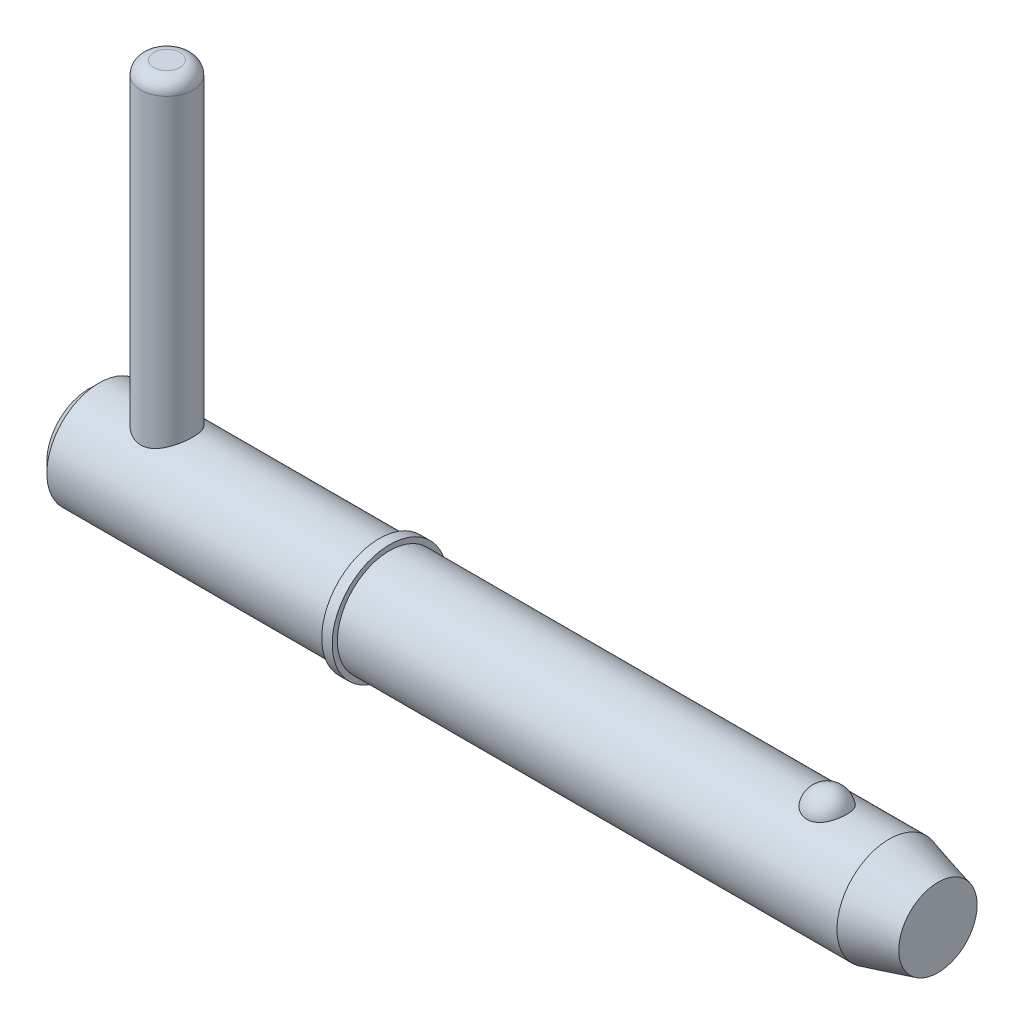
ISO-10303-21;
HEADER;
FILE_DESCRIPTION(('STEP AP214'),'2;1');
FILE_NAME('part.step','',(''),(''),'','','');
FILE_SCHEMA(('AUTOMOTIVE_DESIGN { 1 0 10303 214 1 1 1 1 }'));
ENDSEC;
DATA;
#1=APPLICATION_CONTEXT('core data for automotive mechanical design processes');
#2=APPLICATION_PROTOCOL_DEFINITION('international standard','automotive_design',2000,#1);
#3=PRODUCT_CONTEXT('',#1,'mechanical');
#4=PRODUCT('Part','Part','',(#3));
#5=PRODUCT_RELATED_PRODUCT_CATEGORY('part','',(#4));
#6=PRODUCT_DEFINITION_FORMATION('','',#4);
#7=PRODUCT_DEFINITION_CONTEXT('part definition',#1,'design');
#8=PRODUCT_DEFINITION('design','',#6,#7);
#9=PRODUCT_DEFINITION_SHAPE('','',#8);
#10=(LENGTH_UNIT() NAMED_UNIT(*) SI_UNIT(.MILLI.,.METRE.));
#11=(NAMED_UNIT(*) PLANE_ANGLE_UNIT() SI_UNIT($,.RADIAN.));
#12=(NAMED_UNIT(*) SI_UNIT($,.STERADIAN.) SOLID_ANGLE_UNIT());
#13=UNCERTAINTY_MEASURE_WITH_UNIT(LENGTH_MEASURE(1.E-05),#10,'distance_accuracy_value','');
#14=(GEOMETRIC_REPRESENTATION_CONTEXT(3) GLOBAL_UNCERTAINTY_ASSIGNED_CONTEXT((#13)) GLOBAL_UNIT_ASSIGNED_CONTEXT((#10,
#11,#12)) REPRESENTATION_CONTEXT('',''));
#15=CARTESIAN_POINT('',(0.,0.,0.));
#16=DIRECTION('',(0.,0.,1.));
#17=DIRECTION('',(1.,0.,0.));
#18=AXIS2_PLACEMENT_3D('',#15,#16,#17);
#19=CARTESIAN_POINT('',(4.755,22.225,0.));
#20=DIRECTION('',(0.,-1.,0.));
#21=DIRECTION('',(0.,0.,-1.));
#22=AXIS2_PLACEMENT_3D('',#19,#20,#21);
#23=CYLINDRICAL_SURFACE('',#22,1.585);
#24=CARTESIAN_POINT('',(4.755,-2.3825,0.));
#25=DIRECTION('',(0.,1.,0.));
#26=DIRECTION('',(0.,0.,1.));
#27=AXIS2_PLACEMENT_3D('',#24,#25,#26);
#28=CIRCLE('',#27,1.585);
#29=CARTESIAN_POINT('',(4.755,-2.3825,1.585));
#30=VERTEX_POINT('',#29);
#31=EDGE_CURVE('P0_E25',#30,#30,#28,.T.);
#32=ORIENTED_EDGE('',*,*,#31,.T.);
#33=EDGE_LOOP('',(#32));
#34=FACE_BOUND('',#33,.T.);
#35=CARTESIAN_POINT('',(4.755,21.4325,0.));
#36=DIRECTION('',(0.,1.,0.));
#37=DIRECTION('',(0.,0.,1.));
#38=AXIS2_PLACEMENT_3D('',#35,#36,#37);
#39=CIRCLE('',#38,1.585);
#40=CARTESIAN_POINT('',(4.755,21.4325,1.585));
#41=VERTEX_POINT('',#40);
#42=EDGE_CURVE('P0_E29',#41,#41,#39,.F.);
#43=ORIENTED_EDGE('',*,*,#42,.T.);
#44=EDGE_LOOP('',(#43));
#45=FACE_BOUND('',#44,.T.);
#46=ADVANCED_FACE('P0_F14',(#34,#45),#23,.T.);
#47=CARTESIAN_POINT('',(4.755,22.225,0.));
#48=DIRECTION('',(0.,1.,0.));
#49=DIRECTION('',(0.,0.,1.));
#50=AXIS2_PLACEMENT_3D('',#47,#48,#49);
#51=PLANE('',#50);
#52=CARTESIAN_POINT('',(4.755,22.225,0.));
#53=DIRECTION('',(0.,1.,0.));
#54=DIRECTION('',(0.,0.,1.));
#55=AXIS2_PLACEMENT_3D('',#52,#53,#54);
#56=CIRCLE('',#55,0.7925);
#57=CARTESIAN_POINT('',(4.755,22.225,0.7925));
#58=VERTEX_POINT('',#57);
#59=EDGE_CURVE('P0_E10',#58,#58,#56,.T.);
#60=ORIENTED_EDGE('',*,*,#59,.T.);
#61=EDGE_LOOP('',(#60));
#62=FACE_BOUND('',#61,.T.);
#63=ADVANCED_FACE('P0_F46',(#62),#51,.T.);
#64=CARTESIAN_POINT('',(4.755,-3.175,0.));
#65=DIRECTION('',(0.,1.,0.));
#66=DIRECTION('',(0.,0.,1.));
#67=AXIS2_PLACEMENT_3D('',#64,#65,#66);
#68=PLANE('',#67);
#69=CARTESIAN_POINT('',(4.755,-3.175,0.));
#70=DIRECTION('',(0.,1.,0.));
#71=DIRECTION('',(0.,0.,1.));
#72=AXIS2_PLACEMENT_3D('',#69,#70,#71);
#73=CIRCLE('',#72,0.7925);
#74=CARTESIAN_POINT('',(4.755,-3.175,0.7925));
#75=VERTEX_POINT('',#74);
#76=EDGE_CURVE('P0_E21',#75,#75,#73,.F.);
#77=ORIENTED_EDGE('',*,*,#76,.T.);
#78=EDGE_LOOP('',(#77));
#79=FACE_BOUND('',#78,.T.);
#80=ADVANCED_FACE('P0_F43',(#79),#68,.F.);
#81=CARTESIAN_POINT('',(4.755,-2.3825,0.));
#82=DIRECTION('',(0.,1.,0.));
#83=DIRECTION('',(0.,0.,1.));
#84=AXIS2_PLACEMENT_3D('',#81,#82,#83);
#85=DEGENERATE_TOROIDAL_SURFACE('',#84,0.7925,0.7925,.T.);
#86=ORIENTED_EDGE('',*,*,#76,.F.);
#87=EDGE_LOOP('',(#86));
#88=FACE_BOUND('',#87,.T.);
#89=ORIENTED_EDGE('',*,*,#31,.F.);
#90=EDGE_LOOP('',(#89));
#91=FACE_BOUND('',#90,.T.);
#92=ADVANCED_FACE('P0_F38',(#88,#91),#85,.T.);
#93=CARTESIAN_POINT('',(4.755,21.4325,0.));
#94=DIRECTION('',(0.,1.,0.));
#95=DIRECTION('',(0.,0.,1.));
#96=AXIS2_PLACEMENT_3D('',#93,#94,#95);
#97=DEGENERATE_TOROIDAL_SURFACE('',#96,0.7925,0.7925,.T.);
#98=ORIENTED_EDGE('',*,*,#42,.F.);
#99=EDGE_LOOP('',(#98));
#100=FACE_BOUND('',#99,.T.);
#101=ORIENTED_EDGE('',*,*,#59,.F.);
#102=EDGE_LOOP('',(#101));
#103=FACE_BOUND('',#102,.T.);
#104=ADVANCED_FACE('P0_F16',(#100,#103),#97,.T.);
#105=CLOSED_SHELL('',(#46,#63,#80,#92,#104));
#106=MANIFOLD_SOLID_BREP('P0_B1',#105);
#107=CARTESIAN_POINT('',(0.,0.,0.));
#108=DIRECTION('',(1.,0.,0.));
#109=DIRECTION('',(0.,0.,-1.));
#110=AXIS2_PLACEMENT_3D('',#107,#108,#109);
#111=CYLINDRICAL_SURFACE('',#110,3.175);
#112=CARTESIAN_POINT('',(48.6476846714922,0.,0.));
#113=DIRECTION('',(1.,0.,0.));
#114=DIRECTION('',(0.,0.,-1.));
#115=AXIS2_PLACEMENT_3D('',#112,#113,#114);
#116=CIRCLE('',#115,3.175);
#117=CARTESIAN_POINT('',(48.6476846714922,0.,-3.175));
#118=VERTEX_POINT('',#117);
#119=EDGE_CURVE('P1_E81',#118,#118,#116,.T.);
#120=ORIENTED_EDGE('',*,*,#119,.F.);
#121=EDGE_LOOP('',(#120));
#122=FACE_BOUND('',#121,.T.);
#123=CARTESIAN_POINT('',(18.29,0.,0.));
#124=DIRECTION('',(1.,0.,0.));
#125=DIRECTION('',(0.,0.,-1.));
#126=AXIS2_PLACEMENT_3D('',#123,#124,#125);
#127=CIRCLE('',#126,3.175);
#128=CARTESIAN_POINT('',(18.29,0.,-3.175));
#129=VERTEX_POINT('',#128);
#130=EDGE_CURVE('P1_E85',#129,#129,#127,.T.);
#131=ORIENTED_EDGE('',*,*,#130,.T.);
#132=EDGE_LOOP('',(#131));
#133=FACE_BOUND('',#132,.T.);
#134=CARTESIAN_POINT('',(44.8757276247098,2.92898950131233,1.2254164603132));
#135=CARTESIAN_POINT('',(44.812316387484,2.92899434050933,1.22541146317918));
#136=CARTESIAN_POINT('',(44.7487979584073,2.93112688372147,1.2203464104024));
#137=CARTESIAN_POINT('',(44.6235306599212,2.93942752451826,1.20020949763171));
#138=CARTESIAN_POINT('',(44.5617869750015,2.9456063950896,1.18511092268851));
#139=CARTESIAN_POINT('',(44.4420651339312,2.96127115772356,1.14540352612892));
#140=CARTESIAN_POINT('',(44.3840775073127,2.97074831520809,1.12081980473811));
#141=CARTESIAN_POINT('',(44.2731943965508,2.99197584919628,1.06285154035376));
#142=CARTESIAN_POINT('',(44.2202966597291,3.0037252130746,1.02947091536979));
#143=CARTESIAN_POINT('',(44.1192688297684,3.02865714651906,0.95367409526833));
#144=CARTESIAN_POINT('',(44.071324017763,3.04187163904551,0.911021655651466));
#145=CARTESIAN_POINT('',(43.9830360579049,3.06808741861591,0.818400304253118));
#146=CARTESIAN_POINT('',(43.9426952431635,3.08108863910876,0.768429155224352));
#147=CARTESIAN_POINT('',(43.8688039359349,3.10614903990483,0.6600648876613));
#148=CARTESIAN_POINT('',(43.8356330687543,3.11814104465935,0.601396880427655));
#149=CARTESIAN_POINT('',(43.7791190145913,3.13926931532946,0.479026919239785));
#150=CARTESIAN_POINT('',(43.7557764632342,3.14840539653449,0.415324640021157));
#151=CARTESIAN_POINT('',(43.7191785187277,3.16298160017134,0.283885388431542));
#152=CARTESIAN_POINT('',(43.7060407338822,3.16837855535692,0.216110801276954));
#153=CARTESIAN_POINT('',(43.6905676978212,3.17475386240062,0.0791367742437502));
#154=CARTESIAN_POINT('',(43.688232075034,3.17573236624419,0.00993738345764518));
#155=CARTESIAN_POINT('',(43.694388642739,3.17318075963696,-0.127420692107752));
#156=CARTESIAN_POINT('',(43.7028073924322,3.16968122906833,-0.195583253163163));
#157=CARTESIAN_POINT('',(43.7301752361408,3.1585790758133,-0.329413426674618));
#158=CARTESIAN_POINT('',(43.7491245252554,3.15097637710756,-0.395080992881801));
#159=CARTESIAN_POINT('',(43.7972057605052,3.13242485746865,-0.522180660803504));
#160=CARTESIAN_POINT('',(43.8263524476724,3.12147119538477,-0.583606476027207));
#161=CARTESIAN_POINT('',(43.8942352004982,3.09734973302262,-0.700436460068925));
#162=CARTESIAN_POINT('',(43.932972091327,3.08418174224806,-0.7558401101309));
#163=CARTESIAN_POINT('',(44.0194771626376,3.05694884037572,-0.859404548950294));
#164=CARTESIAN_POINT('',(44.0672961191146,3.04287919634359,-0.907521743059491));
#165=CARTESIAN_POINT('',(44.1707353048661,3.01548927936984,-0.994758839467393));
#166=CARTESIAN_POINT('',(44.2263549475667,3.00216895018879,-1.03387941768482));
#167=CARTESIAN_POINT('',(44.3428093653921,2.97810316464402,-1.10126594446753));
#168=CARTESIAN_POINT('',(44.4035182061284,2.96731170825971,-1.12973256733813));
#169=CARTESIAN_POINT('',(44.5293712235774,2.9492893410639,-1.17598467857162));
#170=CARTESIAN_POINT('',(44.5945137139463,2.94205708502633,-1.19377420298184));
#171=CARTESIAN_POINT('',(44.7238562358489,2.93233065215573,-1.21746387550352));
#172=CARTESIAN_POINT('',(44.7879385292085,2.92961621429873,-1.22391763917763));
#173=CARTESIAN_POINT('',(44.9163375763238,2.92855752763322,-1.22644976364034));
#174=CARTESIAN_POINT('',(44.980654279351,2.93021238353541,-1.22253024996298));
#175=CARTESIAN_POINT('',(45.1055239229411,2.9375685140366,-1.20474140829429));
#176=CARTESIAN_POINT('',(45.166131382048,2.94313790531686,-1.19119621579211));
#177=CARTESIAN_POINT('',(45.2841106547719,2.95756226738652,-1.15491492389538));
#178=CARTESIAN_POINT('',(45.3414822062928,2.96641750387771,-1.13217808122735));
#179=CARTESIAN_POINT('',(45.4527699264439,2.98669918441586,-1.07755083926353));
#180=CARTESIAN_POINT('',(45.5065845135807,2.9981771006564,-1.0454730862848));
#181=CARTESIAN_POINT('',(45.6081473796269,3.02240235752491,-0.973220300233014));
#182=CARTESIAN_POINT('',(45.6558942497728,3.03514999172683,-0.933043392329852));
#183=CARTESIAN_POINT('',(45.7465817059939,3.06131230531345,-0.843372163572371));
#184=CARTESIAN_POINT('',(45.7891588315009,3.07472822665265,-0.793510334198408));
#185=CARTESIAN_POINT('',(45.8656765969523,3.10021106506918,-0.687241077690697));
#186=CARTESIAN_POINT('',(45.8996156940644,3.1122777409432,-0.630832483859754));
#187=CARTESIAN_POINT('',(45.9591209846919,3.134208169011,-0.511059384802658));
#188=CARTESIAN_POINT('',(45.9843892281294,3.14399040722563,-0.447531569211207));
#189=CARTESIAN_POINT('',(46.0245117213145,3.15983820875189,-0.316827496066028));
#190=CARTESIAN_POINT('',(46.0393659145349,3.16590375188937,-0.249651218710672));
#191=CARTESIAN_POINT('',(46.058358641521,3.17370076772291,-0.11354918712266));
#192=CARTESIAN_POINT('',(46.0624966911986,3.17543204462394,-0.0446233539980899));
#193=CARTESIAN_POINT('',(46.0599697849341,3.17438372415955,0.0929938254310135));
#194=CARTESIAN_POINT('',(46.0533050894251,3.17160423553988,0.161685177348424));
#195=CARTESIAN_POINT('',(46.0293754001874,3.1618438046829,0.296502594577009));
#196=CARTESIAN_POINT('',(46.0121674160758,3.15488546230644,0.362640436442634));
#197=CARTESIAN_POINT('',(45.967547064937,3.13748892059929,0.490896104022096));
#198=CARTESIAN_POINT('',(45.9401339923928,3.12705048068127,0.553013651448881));
#199=CARTESIAN_POINT('',(45.8754626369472,3.10369139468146,0.671876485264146));
#200=CARTESIAN_POINT('',(45.8381467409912,3.0907563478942,0.728587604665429));
#201=CARTESIAN_POINT('',(45.7545246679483,3.06381731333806,0.834653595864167));
#202=CARTESIAN_POINT('',(45.7082189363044,3.04981337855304,0.884008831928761));
#203=CARTESIAN_POINT('',(45.6077184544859,3.02230423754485,0.973916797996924));
#204=CARTESIAN_POINT('',(45.553535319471,3.00879833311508,1.01448227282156));
#205=CARTESIAN_POINT('',(45.4385299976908,2.98383625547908,1.0857155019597));
#206=CARTESIAN_POINT('',(45.3777053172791,2.9723808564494,1.11637952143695));
#207=CARTESIAN_POINT('',(45.2533690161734,2.95329063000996,1.16592590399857));
#208=CARTESIAN_POINT('',(45.1900230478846,2.9455373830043,1.18517901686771));
#209=CARTESIAN_POINT('',(45.0607664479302,2.9342556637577,1.21284802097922));
#210=CARTESIAN_POINT('',(44.9948641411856,2.93071450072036,1.2212964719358));
#211=CARTESIAN_POINT('',(44.911116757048,2.9291525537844,1.22502505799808));
#212=CARTESIAN_POINT('',(44.8934263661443,2.92898815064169,1.22541785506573));
#213=CARTESIAN_POINT('',(44.8757276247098,2.92898950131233,1.2254164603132));
#214=B_SPLINE_CURVE_WITH_KNOTS('',3,(#134,#135,#136,#137,#138,#139,#140,#141,#142,#143,#144,
#145,#146,#147,#148,#149,#150,#151,#152,#153,#154,#155,#156,#157,#158,#159,#160,#161,#162,#163,
#164,#165,#166,#167,#168,#169,#170,#171,#172,#173,#174,#175,#176,#177,#178,#179,#180,#181,#182,
#183,#184,#185,#186,#187,#188,#189,#190,#191,#192,#193,#194,#195,#196,#197,#198,#199,#200,#201,
#202,#203,#204,#205,#206,#207,#208,#209,#210,#211,#212,#213),.UNSPECIFIED.,.T.,.F.,(4,2,2,2,2,2,
2,2,2,2,2,2,2,2,2,2,2,2,2,2,2,2,2,2,2,2,2,2,2,2,2,2,2,2,2,2,2,2,2,4),(0.,0.190186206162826,
0.380880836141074,0.571074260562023,0.761183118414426,0.956866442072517,1.15260970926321,
1.35701770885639,1.56143892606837,1.76818248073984,1.97491892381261,2.18025109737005,
2.38558707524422,2.59122111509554,2.79687285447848,3.00371012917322,3.2105318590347,
3.41323429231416,3.61586005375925,3.80828192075,4.00066436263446,4.18685798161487,
4.37306665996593,4.56330302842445,4.75358348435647,4.95345287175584,5.15335793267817,
5.35957003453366,5.56578325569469,5.77200579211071,5.97822335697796,6.183335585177,
6.38846199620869,6.59480900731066,6.80114579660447,7.00718137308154,7.21329457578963,
7.41228022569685,7.61066481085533,7.66374777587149),.UNSPECIFIED.);
#215=CARTESIAN_POINT('',(44.8757276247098,2.92898950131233,1.2254164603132));
#216=VERTEX_POINT('',#215);
#217=EDGE_CURVE('P1_E35',#216,#216,#214,.T.);
#218=ORIENTED_EDGE('',*,*,#217,.T.);
#219=EDGE_LOOP('',(#218));
#220=FACE_BOUND('',#219,.T.);
#221=ADVANCED_FACE('P1_F13',(#122,#133,#220),#111,.T.);
#222=CARTESIAN_POINT('',(0.,0.,0.));
#223=DIRECTION('',(-1.,0.,0.));
#224=DIRECTION('',(0.,0.,1.));
#225=AXIS2_PLACEMENT_3D('',#222,#223,#224);
#226=PLANE('',#225);
#227=CARTESIAN_POINT('',(0.,0.,0.));
#228=DIRECTION('',(1.,0.,0.));
#229=DIRECTION('',(0.,0.,-1.));
#230=AXIS2_PLACEMENT_3D('',#227,#228,#229);
#231=CIRCLE('',#230,2.54);
#232=CARTESIAN_POINT('',(0.,0.,-2.54));
#233=VERTEX_POINT('',#232);
#234=EDGE_CURVE('P1_E9',#233,#233,#231,.T.);
#235=ORIENTED_EDGE('',*,*,#234,.F.);
#236=EDGE_LOOP('',(#235));
#237=FACE_BOUND('',#236,.T.);
#238=ADVANCED_FACE('P1_F15',(#237),#226,.T.);
#239=CARTESIAN_POINT('',(0.634999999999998,0.,0.));
#240=DIRECTION('',(1.,0.,0.));
#241=DIRECTION('',(0.,0.,-1.));
#242=AXIS2_PLACEMENT_3D('',#239,#240,#241);
#243=CONICAL_SURFACE('',#242,3.175,0.78539816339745);
#244=ORIENTED_EDGE('',*,*,#234,.T.);
#245=EDGE_LOOP('',(#244));
#246=FACE_BOUND('',#245,.T.);
#247=CARTESIAN_POINT('',(0.634999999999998,0.,0.));
#248=DIRECTION('',(1.,0.,0.));
#249=DIRECTION('',(0.,0.,-1.));
#250=AXIS2_PLACEMENT_3D('',#247,#248,#249);
#251=CIRCLE('',#250,3.175);
#252=CARTESIAN_POINT('',(0.634999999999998,0.,-3.175));
#253=VERTEX_POINT('',#252);
#254=EDGE_CURVE('P1_E26',#253,#253,#251,.T.);
#255=ORIENTED_EDGE('',*,*,#254,.F.);
#256=EDGE_LOOP('',(#255));
#257=FACE_BOUND('',#256,.T.);
#258=ADVANCED_FACE('P1_F77',(#246,#257),#243,.T.);
#259=CARTESIAN_POINT('',(0.,0.,0.));
#260=DIRECTION('',(1.,0.,0.));
#261=DIRECTION('',(0.,0.,-1.));
#262=AXIS2_PLACEMENT_3D('',#259,#260,#261);
#263=CYLINDRICAL_SURFACE('',#262,3.175);
#264=CARTESIAN_POINT('',(4.755,-2.75107251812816,1.585));
#265=CARTESIAN_POINT('',(4.67238891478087,-2.7510796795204,1.58499425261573));
#266=CARTESIAN_POINT('',(4.58967306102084,-2.75485010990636,1.57849830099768));
#267=CARTESIAN_POINT('',(4.42677850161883,-2.76938647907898,1.55284486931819));
#268=CARTESIAN_POINT('',(4.34660551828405,-2.78016716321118,1.53366069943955));
#269=CARTESIAN_POINT('',(4.19146029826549,-2.80716278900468,1.48366329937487));
#270=CARTESIAN_POINT('',(4.11646293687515,-2.8233488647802,1.45291173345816));
#271=CARTESIAN_POINT('',(3.97271079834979,-2.85928672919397,1.38084067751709));
#272=CARTESIAN_POINT('',(3.90395634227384,-2.87903870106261,1.33952064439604));
#273=CARTESIAN_POINT('',(3.76839976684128,-2.921867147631,1.24350234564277));
#274=CARTESIAN_POINT('',(3.702222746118,-2.94508343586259,1.18798355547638));
#275=CARTESIAN_POINT('',(3.5796334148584,-2.99109588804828,1.06685014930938));
#276=CARTESIAN_POINT('',(3.52322596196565,-3.01389183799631,1.00123054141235));
#277=CARTESIAN_POINT('',(3.41807024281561,-3.05832598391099,0.856373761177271));
#278=CARTESIAN_POINT('',(3.37009053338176,-3.07978367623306,0.776518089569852));
#279=CARTESIAN_POINT('',(3.28853137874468,-3.11730894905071,0.608596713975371));
#280=CARTESIAN_POINT('',(3.25494287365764,-3.1333799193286,0.520536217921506));
#281=CARTESIAN_POINT('',(3.20559401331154,-3.15731341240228,0.345327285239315));
#282=CARTESIAN_POINT('',(3.18873760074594,-3.16567752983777,0.258557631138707));
#283=CARTESIAN_POINT('',(3.16972238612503,-3.17512718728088,0.0830496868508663));
#284=CARTESIAN_POINT('',(3.16755472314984,-3.17621711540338,-0.00568738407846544));
#285=CARTESIAN_POINT('',(3.1775542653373,-3.17123385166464,-0.174372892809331));
#286=CARTESIAN_POINT('',(3.18849502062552,-3.16577346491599,-0.254416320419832));
#287=CARTESIAN_POINT('',(3.22220680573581,-3.14922844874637,-0.411354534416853));
#288=CARTESIAN_POINT('',(3.2449787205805,-3.13814339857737,-0.488249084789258));
#289=CARTESIAN_POINT('',(3.30185558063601,-3.111172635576,-0.638050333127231));
#290=CARTESIAN_POINT('',(3.33611332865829,-3.09522247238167,-0.710886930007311));
#291=CARTESIAN_POINT('',(3.41477890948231,-3.05996035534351,-0.849953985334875));
#292=CARTESIAN_POINT('',(3.45919037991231,-3.04064719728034,-0.916182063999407));
#293=CARTESIAN_POINT('',(3.5617148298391,-2.99832415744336,-1.04681642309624));
#294=CARTESIAN_POINT('',(3.62072497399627,-2.97513741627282,-1.11046186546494));
#295=CARTESIAN_POINT('',(3.7483697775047,-2.92885066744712,-1.22736291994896));
#296=CARTESIAN_POINT('',(3.81701173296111,-2.90575073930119,-1.2806105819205));
#297=CARTESIAN_POINT('',(3.96727993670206,-2.86067370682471,-1.37849835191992));
#298=CARTESIAN_POINT('',(4.04945242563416,-2.83885964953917,-1.42238246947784));
#299=CARTESIAN_POINT('',(4.2213558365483,-2.80110454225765,-1.49537418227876));
#300=CARTESIAN_POINT('',(4.3110787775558,-2.78515738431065,-1.52449715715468));
#301=CARTESIAN_POINT('',(4.48806324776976,-2.76271292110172,-1.56478065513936));
#302=CARTESIAN_POINT('',(4.57495732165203,-2.75556745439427,-1.57718067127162));
#303=CARTESIAN_POINT('',(4.74985771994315,-2.74969306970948,-1.58740564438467));
#304=CARTESIAN_POINT('',(4.8378632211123,-2.75095824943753,-1.58524082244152));
#305=CARTESIAN_POINT('',(5.00227282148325,-2.76107477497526,-1.56753530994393));
#306=CARTESIAN_POINT('',(5.07889680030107,-2.76908515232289,-1.55347662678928));
#307=CARTESIAN_POINT('',(5.22855309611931,-2.79054849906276,-1.51458035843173));
#308=CARTESIAN_POINT('',(5.30158424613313,-2.80400322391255,-1.489739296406));
#309=CARTESIAN_POINT('',(5.44583114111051,-2.83556995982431,-1.42877335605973));
#310=CARTESIAN_POINT('',(5.51680600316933,-2.85386886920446,-1.39217900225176));
#311=CARTESIAN_POINT('',(5.6520174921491,-2.89289503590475,-1.30915485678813));
#312=CARTESIAN_POINT('',(5.71625063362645,-2.91362353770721,-1.26272001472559));
#313=CARTESIAN_POINT('',(5.8445938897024,-2.95830220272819,-1.15451693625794));
#314=CARTESIAN_POINT('',(5.90767560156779,-2.98233004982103,-1.09155543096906));
#315=CARTESIAN_POINT('',(6.0226995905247,-3.02864458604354,-0.955560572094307));
#316=CARTESIAN_POINT('',(6.07463814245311,-3.05093069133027,-0.882523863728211));
#317=CARTESIAN_POINT('',(6.16704288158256,-3.09200671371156,-0.725836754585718));
#318=CARTESIAN_POINT('',(6.20717458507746,-3.11069030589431,-0.64195924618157));
#319=CARTESIAN_POINT('',(6.27235859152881,-3.1416474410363,-0.467442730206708));
#320=CARTESIAN_POINT('',(6.29742409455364,-3.15392659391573,-0.376809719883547));
#321=CARTESIAN_POINT('',(6.32960989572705,-3.16979844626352,-0.200314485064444));
#322=CARTESIAN_POINT('',(6.33816324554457,-3.17408359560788,-0.114775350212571));
#323=CARTESIAN_POINT('',(6.34130309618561,-3.17565001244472,0.0566108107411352));
#324=CARTESIAN_POINT('',(6.33589445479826,-3.17293371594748,0.142457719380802));
#325=CARTESIAN_POINT('',(6.31221457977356,-3.16120608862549,0.306097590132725));
#326=CARTESIAN_POINT('',(6.2948097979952,-3.15261910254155,0.38404960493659));
#327=CARTESIAN_POINT('',(6.24879775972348,-3.13040364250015,0.535801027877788));
#328=CARTESIAN_POINT('',(6.22018889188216,-3.11677444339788,0.609599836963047));
#329=CARTESIAN_POINT('',(6.15130303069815,-3.08497808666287,0.754502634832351));
#330=CARTESIAN_POINT('',(6.11057850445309,-3.0666414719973,0.82535556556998));
#331=CARTESIAN_POINT('',(6.01917980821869,-3.02735012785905,0.95951596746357));
#332=CARTESIAN_POINT('',(5.96850106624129,-3.00639419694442,1.02281994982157));
#333=CARTESIAN_POINT('',(5.8528006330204,-2.96149402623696,1.1467073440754));
#334=CARTESIAN_POINT('',(5.78685463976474,-2.93745961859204,1.20639723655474));
#335=CARTESIAN_POINT('',(5.64552278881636,-2.89084502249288,1.31419099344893));
#336=CARTESIAN_POINT('',(5.57012871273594,-2.8682661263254,1.36228466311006));
#337=CARTESIAN_POINT('',(5.40892145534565,-2.82661780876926,1.44677201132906));
#338=CARTESIAN_POINT('',(5.32285703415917,-2.80767948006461,1.48275497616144));
#339=CARTESIAN_POINT('',(5.14469010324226,-2.77716572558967,1.53916557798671));
#340=CARTESIAN_POINT('',(5.05260892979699,-2.76556569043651,1.55964525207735));
#341=CARTESIAN_POINT('',(4.92544162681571,-2.75613775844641,1.57618070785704));
#342=CARTESIAN_POINT('',(4.89147210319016,-2.75424493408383,1.57948285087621));
#343=CARTESIAN_POINT('',(4.82334103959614,-2.75171079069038,1.58389375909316));
#344=CARTESIAN_POINT('',(4.78917948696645,-2.75106955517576,1.58500237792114));
#345=CARTESIAN_POINT('',(4.755,-2.75107251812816,1.585));
#346=B_SPLINE_CURVE_WITH_KNOTS('',3,(#264,#265,#266,#267,#268,#269,#270,#271,#272,#273,#274,
#275,#276,#277,#278,#279,#280,#281,#282,#283,#284,#285,#286,#287,#288,#289,#290,#291,#292,#293,
#294,#295,#296,#297,#298,#299,#300,#301,#302,#303,#304,#305,#306,#307,#308,#309,#310,#311,#312,
#313,#314,#315,#316,#317,#318,#319,#320,#321,#322,#323,#324,#325,#326,#327,#328,#329,#330,#331,
#332,#333,#334,#335,#336,#337,#338,#339,#340,#341,#342,#343,#344,#345),.UNSPECIFIED.,.T.,.F.,(4,
2,2,2,2,2,2,2,2,2,2,2,2,2,2,2,2,2,2,2,2,2,2,2,2,2,2,2,2,2,2,2,2,2,2,2,2,2,2,2,4),(0.,
0.247689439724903,0.495901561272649,0.742808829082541,0.989728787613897,1.25694656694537,
1.52429683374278,1.80959781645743,2.0947189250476,2.35960564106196,2.62433255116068,
2.86610932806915,3.1079041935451,3.35305262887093,3.59828902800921,3.86665310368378,
4.13522157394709,4.4207514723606,4.70598326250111,4.9686344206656,5.23110127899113,
5.46499114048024,5.69895647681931,5.94376186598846,6.1886932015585,6.46438263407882,
6.74016408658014,7.0231370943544,7.30586181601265,7.5626977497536,7.81944433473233,
8.05935987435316,8.29930993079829,8.54954401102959,8.79989329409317,9.07508848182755,
9.35052473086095,9.63453318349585,9.91758407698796,10.0200561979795,10.1225351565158),.UNSPECIFIED.);
#347=CARTESIAN_POINT('',(4.755,-2.75107251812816,1.585));
#348=VERTEX_POINT('',#347);
#349=EDGE_CURVE('P1_E17',#348,#348,#346,.T.);
#350=ORIENTED_EDGE('',*,*,#349,.F.);
#351=EDGE_LOOP('',(#350));
#352=FACE_BOUND('',#351,.T.);
#353=CARTESIAN_POINT('',(4.755,2.75107251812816,1.585));
#354=CARTESIAN_POINT('',(4.83761108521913,2.7510796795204,1.58499425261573));
#355=CARTESIAN_POINT('',(4.92032693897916,2.75485010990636,1.57849830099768));
#356=CARTESIAN_POINT('',(5.08322149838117,2.76938647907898,1.55284486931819));
#357=CARTESIAN_POINT('',(5.16339448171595,2.78016716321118,1.53366069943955));
#358=CARTESIAN_POINT('',(5.31853970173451,2.80716278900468,1.48366329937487));
#359=CARTESIAN_POINT('',(5.39353706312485,2.8233488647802,1.45291173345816));
#360=CARTESIAN_POINT('',(5.53728920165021,2.85928672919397,1.38084067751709));
#361=CARTESIAN_POINT('',(5.60604365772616,2.87903870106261,1.33952064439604));
#362=CARTESIAN_POINT('',(5.74160023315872,2.921867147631,1.24350234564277));
#363=CARTESIAN_POINT('',(5.807777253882,2.94508343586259,1.18798355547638));
#364=CARTESIAN_POINT('',(5.9303665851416,2.99109588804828,1.06685014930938));
#365=CARTESIAN_POINT('',(5.98677403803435,3.01389183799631,1.00123054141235));
#366=CARTESIAN_POINT('',(6.09192975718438,3.05832598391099,0.85637376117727));
#367=CARTESIAN_POINT('',(6.13990946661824,3.07978367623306,0.776518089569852));
#368=CARTESIAN_POINT('',(6.22146862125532,3.11730894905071,0.608596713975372));
#369=CARTESIAN_POINT('',(6.25505712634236,3.1333799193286,0.520536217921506));
#370=CARTESIAN_POINT('',(6.30440598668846,3.15731341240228,0.345327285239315));
#371=CARTESIAN_POINT('',(6.32126239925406,3.16567752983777,0.258557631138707));
#372=CARTESIAN_POINT('',(6.34027761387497,3.17512718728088,0.0830496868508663));
#373=CARTESIAN_POINT('',(6.34244527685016,3.17621711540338,-0.00568738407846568));
#374=CARTESIAN_POINT('',(6.3324457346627,3.17123385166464,-0.174372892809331));
#375=CARTESIAN_POINT('',(6.32150497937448,3.16577346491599,-0.254416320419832));
#376=CARTESIAN_POINT('',(6.28779319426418,3.14922844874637,-0.411354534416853));
#377=CARTESIAN_POINT('',(6.2650212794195,3.13814339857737,-0.488249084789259));
#378=CARTESIAN_POINT('',(6.20814441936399,3.111172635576,-0.638050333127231));
#379=CARTESIAN_POINT('',(6.17388667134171,3.09522247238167,-0.710886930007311));
#380=CARTESIAN_POINT('',(6.09522109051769,3.05996035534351,-0.849953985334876));
#381=CARTESIAN_POINT('',(6.05080962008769,3.04064719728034,-0.916182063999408));
#382=CARTESIAN_POINT('',(5.9482851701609,2.99832415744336,-1.04681642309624));
#383=CARTESIAN_POINT('',(5.88927502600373,2.97513741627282,-1.11046186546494));
#384=CARTESIAN_POINT('',(5.7616302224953,2.92885066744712,-1.22736291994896));
#385=CARTESIAN_POINT('',(5.69298826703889,2.90575073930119,-1.2806105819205));
#386=CARTESIAN_POINT('',(5.54272006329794,2.86067370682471,-1.37849835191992));
#387=CARTESIAN_POINT('',(5.46054757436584,2.83885964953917,-1.42238246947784));
#388=CARTESIAN_POINT('',(5.2886441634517,2.80110454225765,-1.49537418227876));
#389=CARTESIAN_POINT('',(5.19892122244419,2.78515738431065,-1.52449715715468));
#390=CARTESIAN_POINT('',(5.02193675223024,2.76271292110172,-1.56478065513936));
#391=CARTESIAN_POINT('',(4.93504267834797,2.75556745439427,-1.57718067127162));
#392=CARTESIAN_POINT('',(4.76014228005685,2.74969306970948,-1.58740564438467));
#393=CARTESIAN_POINT('',(4.6721367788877,2.75095824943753,-1.58524082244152));
#394=CARTESIAN_POINT('',(4.50772717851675,2.76107477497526,-1.56753530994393));
#395=CARTESIAN_POINT('',(4.43110319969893,2.76908515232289,-1.55347662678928));
#396=CARTESIAN_POINT('',(4.28144690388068,2.79054849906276,-1.51458035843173));
#397=CARTESIAN_POINT('',(4.20841575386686,2.80400322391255,-1.489739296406));
#398=CARTESIAN_POINT('',(4.06416885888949,2.83556995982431,-1.42877335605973));
#399=CARTESIAN_POINT('',(3.99319399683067,2.85386886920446,-1.39217900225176));
#400=CARTESIAN_POINT('',(3.8579825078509,2.89289503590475,-1.30915485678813));
#401=CARTESIAN_POINT('',(3.79374936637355,2.91362353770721,-1.26272001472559));
#402=CARTESIAN_POINT('',(3.6654061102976,2.95830220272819,-1.15451693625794));
#403=CARTESIAN_POINT('',(3.60232439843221,2.98233004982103,-1.09155543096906));
#404=CARTESIAN_POINT('',(3.4873004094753,3.02864458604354,-0.955560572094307));
#405=CARTESIAN_POINT('',(3.43536185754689,3.05093069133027,-0.88252386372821));
#406=CARTESIAN_POINT('',(3.34295711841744,3.09200671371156,-0.725836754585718));
#407=CARTESIAN_POINT('',(3.30282541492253,3.11069030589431,-0.64195924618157));
#408=CARTESIAN_POINT('',(3.23764140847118,3.14164744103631,-0.467442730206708));
#409=CARTESIAN_POINT('',(3.21257590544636,3.15392659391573,-0.376809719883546));
#410=CARTESIAN_POINT('',(3.18039010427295,3.16979844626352,-0.200314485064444));
#411=CARTESIAN_POINT('',(3.17183675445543,3.17408359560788,-0.114775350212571));
#412=CARTESIAN_POINT('',(3.16869690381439,3.17565001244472,0.0566108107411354));
#413=CARTESIAN_POINT('',(3.17410554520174,3.17293371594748,0.142457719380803));
#414=CARTESIAN_POINT('',(3.19778542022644,3.16120608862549,0.306097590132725));
#415=CARTESIAN_POINT('',(3.2151902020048,3.15261910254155,0.384049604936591));
#416=CARTESIAN_POINT('',(3.26120224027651,3.13040364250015,0.535801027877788));
#417=CARTESIAN_POINT('',(3.28981110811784,3.11677444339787,0.609599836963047));
#418=CARTESIAN_POINT('',(3.35869696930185,3.08497808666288,0.754502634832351));
#419=CARTESIAN_POINT('',(3.39942149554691,3.0666414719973,0.82535556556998));
#420=CARTESIAN_POINT('',(3.49082019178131,3.02735012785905,0.95951596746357));
#421=CARTESIAN_POINT('',(3.54149893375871,3.00639419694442,1.02281994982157));
#422=CARTESIAN_POINT('',(3.6571993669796,2.96149402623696,1.1467073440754));
#423=CARTESIAN_POINT('',(3.72314536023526,2.93745961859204,1.20639723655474));
#424=CARTESIAN_POINT('',(3.86447721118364,2.89084502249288,1.31419099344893));
#425=CARTESIAN_POINT('',(3.93987128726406,2.8682661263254,1.36228466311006));
#426=CARTESIAN_POINT('',(4.10107854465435,2.82661780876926,1.44677201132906));
#427=CARTESIAN_POINT('',(4.18714296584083,2.80767948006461,1.48275497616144));
#428=CARTESIAN_POINT('',(4.36530989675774,2.77716572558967,1.53916557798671));
#429=CARTESIAN_POINT('',(4.45739107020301,2.76556569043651,1.55964525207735));
#430=CARTESIAN_POINT('',(4.58455837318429,2.75613775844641,1.57618070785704));
#431=CARTESIAN_POINT('',(4.61852789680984,2.75424493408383,1.57948285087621));
#432=CARTESIAN_POINT('',(4.68665896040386,2.75171079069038,1.58389375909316));
#433=CARTESIAN_POINT('',(4.72082051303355,2.75106955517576,1.58500237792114));
#434=CARTESIAN_POINT('',(4.755,2.75107251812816,1.585));
#435=B_SPLINE_CURVE_WITH_KNOTS('',3,(#353,#354,#355,#356,#357,#358,#359,#360,#361,#362,#363,
#364,#365,#366,#367,#368,#369,#370,#371,#372,#373,#374,#375,#376,#377,#378,#379,#380,#381,#382,
#383,#384,#385,#386,#387,#388,#389,#390,#391,#392,#393,#394,#395,#396,#397,#398,#399,#400,#401,
#402,#403,#404,#405,#406,#407,#408,#409,#410,#411,#412,#413,#414,#415,#416,#417,#418,#419,#420,
#421,#422,#423,#424,#425,#426,#427,#428,#429,#430,#431,#432,#433,#434),.UNSPECIFIED.,.T.,.F.,(4,
2,2,2,2,2,2,2,2,2,2,2,2,2,2,2,2,2,2,2,2,2,2,2,2,2,2,2,2,2,2,2,2,2,2,2,2,2,2,2,4),(0.,
0.247689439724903,0.495901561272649,0.742808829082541,0.989728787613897,1.25694656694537,
1.52429683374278,1.80959781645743,2.0947189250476,2.35960564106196,2.62433255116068,
2.86610932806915,3.1079041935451,3.35305262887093,3.59828902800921,3.86665310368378,
4.13522157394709,4.4207514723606,4.70598326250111,4.9686344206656,5.23110127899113,
5.46499114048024,5.69895647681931,5.94376186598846,6.1886932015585,6.46438263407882,
6.74016408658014,7.0231370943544,7.30586181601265,7.5626977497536,7.81944433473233,
8.05935987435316,8.29930993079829,8.54954401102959,8.79989329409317,9.07508848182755,
9.35052473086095,9.63453318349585,9.91758407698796,10.0200561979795,10.1225351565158),.UNSPECIFIED.);
#436=CARTESIAN_POINT('',(4.755,2.75107251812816,1.585));
#437=VERTEX_POINT('',#436);
#438=EDGE_CURVE('P1_E43',#437,#437,#435,.T.);
#439=ORIENTED_EDGE('',*,*,#438,.F.);
#440=EDGE_LOOP('',(#439));
#441=FACE_BOUND('',#440,.T.);
#442=ORIENTED_EDGE('',*,*,#254,.T.);
#443=EDGE_LOOP('',(#442));
#444=FACE_BOUND('',#443,.T.);
#445=CARTESIAN_POINT('',(17.655,0.,0.));
#446=DIRECTION('',(1.,0.,0.));
#447=DIRECTION('',(0.,0.,-1.));
#448=AXIS2_PLACEMENT_3D('',#445,#446,#447);
#449=CIRCLE('',#448,3.175);
#450=CARTESIAN_POINT('',(17.655,0.,-3.175));
#451=VERTEX_POINT('',#450);
#452=EDGE_CURVE('P1_E31',#451,#451,#449,.T.);
#453=ORIENTED_EDGE('',*,*,#452,.F.);
#454=EDGE_LOOP('',(#453));
#455=FACE_BOUND('',#454,.T.);
#456=ADVANCED_FACE('P1_F103',(#352,#441,#444,#455),#263,.T.);
#457=CARTESIAN_POINT('',(17.655,3.175,0.));
#458=DIRECTION('',(-1.,0.,0.));
#459=DIRECTION('',(0.,0.,1.));
#460=AXIS2_PLACEMENT_3D('',#457,#458,#459);
#461=PLANE('',#460);
#462=ORIENTED_EDGE('',*,*,#452,.T.);
#463=EDGE_LOOP('',(#462));
#464=FACE_BOUND('',#463,.T.);
#465=CARTESIAN_POINT('',(17.655,0.,0.));
#466=DIRECTION('',(1.,0.,0.));
#467=DIRECTION('',(0.,0.,-1.));
#468=AXIS2_PLACEMENT_3D('',#465,#466,#467);
#469=CIRCLE('',#468,3.4925);
#470=CARTESIAN_POINT('',(17.655,0.,-3.4925));
#471=VERTEX_POINT('',#470);
#472=EDGE_CURVE('P1_E91',#471,#471,#469,.T.);
#473=ORIENTED_EDGE('',*,*,#472,.F.);
#474=EDGE_LOOP('',(#473));
#475=FACE_BOUND('',#474,.T.);
#476=ADVANCED_FACE('P1_F100',(#464,#475),#461,.T.);
#477=CARTESIAN_POINT('',(0.,0.,0.));
#478=DIRECTION('',(1.,0.,0.));
#479=DIRECTION('',(0.,0.,-1.));
#480=AXIS2_PLACEMENT_3D('',#477,#478,#479);
#481=CYLINDRICAL_SURFACE('',#480,3.4925);
#482=ORIENTED_EDGE('',*,*,#472,.T.);
#483=EDGE_LOOP('',(#482));
#484=FACE_BOUND('',#483,.T.);
#485=CARTESIAN_POINT('',(18.29,0.,0.));
#486=DIRECTION('',(1.,0.,0.));
#487=DIRECTION('',(0.,0.,-1.));
#488=AXIS2_PLACEMENT_3D('',#485,#486,#487);
#489=CIRCLE('',#488,3.4925);
#490=CARTESIAN_POINT('',(18.29,0.,-3.4925));
#491=VERTEX_POINT('',#490);
#492=EDGE_CURVE('P1_E88',#491,#491,#489,.T.);
#493=ORIENTED_EDGE('',*,*,#492,.F.);
#494=EDGE_LOOP('',(#493));
#495=FACE_BOUND('',#494,.T.);
#496=ADVANCED_FACE('P1_F68',(#484,#495),#481,.T.);
#497=CARTESIAN_POINT('',(18.29,3.4925,0.));
#498=DIRECTION('',(1.,0.,0.));
#499=DIRECTION('',(0.,0.,-1.));
#500=AXIS2_PLACEMENT_3D('',#497,#498,#499);
#501=PLANE('',#500);
#502=ORIENTED_EDGE('',*,*,#492,.T.);
#503=EDGE_LOOP('',(#502));
#504=FACE_BOUND('',#503,.T.);
#505=ORIENTED_EDGE('',*,*,#130,.F.);
#506=EDGE_LOOP('',(#505));
#507=FACE_BOUND('',#506,.T.);
#508=ADVANCED_FACE('P1_F62',(#504,#507),#501,.T.);
#509=CARTESIAN_POINT('',(51.61,0.,0.));
#510=DIRECTION('',(-1.,0.,0.));
#511=DIRECTION('',(0.,0.,1.));
#512=AXIS2_PLACEMENT_3D('',#509,#510,#511);
#513=CONICAL_SURFACE('',#512,2.38125000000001,0.26179938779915);
#514=ORIENTED_EDGE('',*,*,#119,.T.);
#515=EDGE_LOOP('',(#514));
#516=FACE_BOUND('',#515,.T.);
#517=CARTESIAN_POINT('',(51.61,0.,0.));
#518=DIRECTION('',(1.,0.,0.));
#519=DIRECTION('',(0.,0.,-1.));
#520=AXIS2_PLACEMENT_3D('',#517,#518,#519);
#521=CIRCLE('',#520,2.38125000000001);
#522=CARTESIAN_POINT('',(51.61,0.,-2.38125000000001));
#523=VERTEX_POINT('',#522);
#524=EDGE_CURVE('P1_E42',#523,#523,#521,.T.);
#525=ORIENTED_EDGE('',*,*,#524,.F.);
#526=EDGE_LOOP('',(#525));
#527=FACE_BOUND('',#526,.T.);
#528=ADVANCED_FACE('P1_F59',(#516,#527),#513,.T.);
#529=CARTESIAN_POINT('',(51.61,2.38125000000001,0.));
#530=DIRECTION('',(1.,0.,0.));
#531=DIRECTION('',(0.,0.,-1.));
#532=AXIS2_PLACEMENT_3D('',#529,#530,#531);
#533=PLANE('',#532);
#534=ORIENTED_EDGE('',*,*,#524,.T.);
#535=EDGE_LOOP('',(#534));
#536=FACE_BOUND('',#535,.T.);
#537=ADVANCED_FACE('P1_F55',(#536),#533,.T.);
#538=CARTESIAN_POINT('',(44.8757276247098,2.8575,0.));
#539=DIRECTION('',(-1.,0.,0.));
#540=DIRECTION('',(0.,1.,0.));
#541=AXIS2_PLACEMENT_3D('',#538,#539,#540);
#542=SPHERICAL_SURFACE('',#541,1.22750000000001);
#543=ORIENTED_EDGE('',*,*,#217,.F.);
#544=EDGE_LOOP('',(#543));
#545=FACE_BOUND('',#544,.T.);
#546=ADVANCED_FACE('P1_F50',(#545),#542,.T.);
#547=CARTESIAN_POINT('',(4.755,-3.4925,0.));
#548=DIRECTION('',(0.,1.,0.));
#549=DIRECTION('',(0.,0.,1.));
#550=AXIS2_PLACEMENT_3D('',#547,#548,#549);
#551=CYLINDRICAL_SURFACE('',#550,1.585);
#552=ORIENTED_EDGE('',*,*,#349,.T.);
#553=EDGE_LOOP('',(#552));
#554=FACE_BOUND('',#553,.T.);
#555=ORIENTED_EDGE('',*,*,#438,.T.);
#556=EDGE_LOOP('',(#555));
#557=FACE_BOUND('',#556,.T.);
#558=ADVANCED_FACE('P1_F54',(#554,#557),#551,.F.);
#559=CLOSED_SHELL('',(#221,#238,#258,#456,#476,#496,#508,#528,#537,#546,#558));
#560=MANIFOLD_SOLID_BREP('P1_B1',#559);
#561=ADVANCED_BREP_SHAPE_REPRESENTATION('',(#18,#106,#560),#14);
#562=SHAPE_DEFINITION_REPRESENTATION(#9,#561);
ENDSEC;
END-ISO-10303-21;
